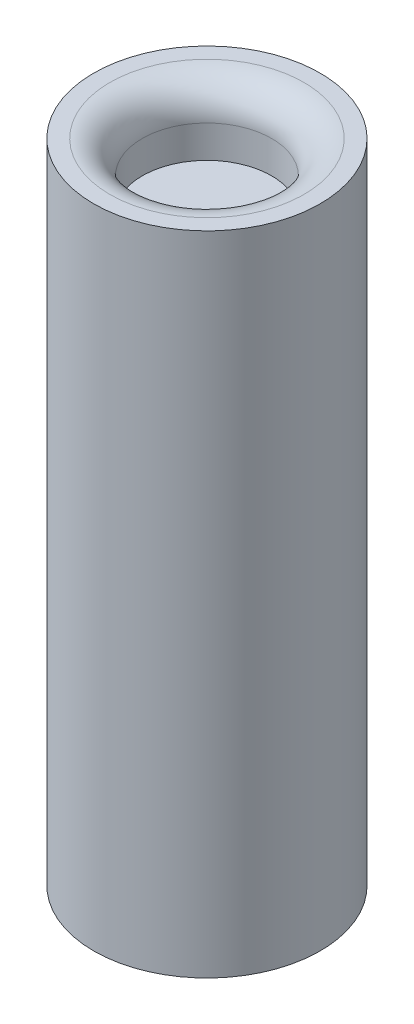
from build123d import *

# Parameters (mm, degrees)
CROQUIS1_R              = 17.5
SALIENTE_EXTRUIR1_DEPTH = 100
CROQUIS2_R              = 10
CORTAR_EXTRUIR2_DEPTH   = 10
REDONDEO2_R             = 5


with BuildPart() as part:
    # Croquis1 → Saliente-Extruir1 (new body)
    with BuildSketch(Plane(origin=(0, 0, 0), x_dir=(1, 0, 0), z_dir=(0, 1, 0))):
        with Locations(Location((0, 0, 0), (0, 0, 270))):
            Circle(CROQUIS1_R)
    extrude(amount=SALIENTE_EXTRUIR1_DEPTH)

    # Croquis2 → Cortar-Extruir2 (cut)
    with BuildSketch(Plane(origin=(0, 100, 0), x_dir=(1, 0, 0), z_dir=(0, 1, 0))):
        with Locations(Location((0, 0, 0), (0, 0, 270))):
            Circle(CROQUIS2_R)
    extrude(amount=-CORTAR_EXTRUIR2_DEPTH, mode=Mode.SUBTRACT)

    # Redondeo2
    redondeo2_edges = [part.edges().sort_by_distance(p)[0] for p in [
        (0, 100, -10),
    ]]
    fillet(redondeo2_edges, radius=REDONDEO2_R)


solid = part.part
